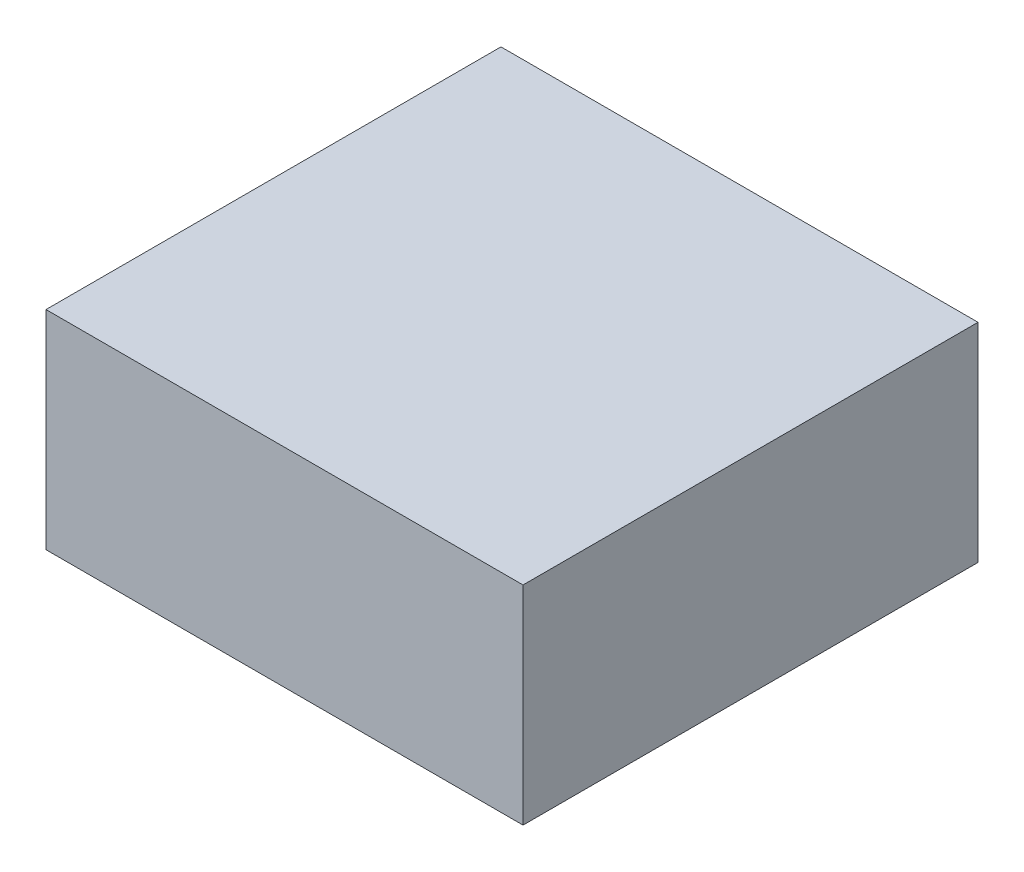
from build123d import *

# Parameters (mm, degrees)
SKETCH1_W          = 13.1064
SKETCH1_H          = 5.715
EXTRUDE1_DEPTH     = 12.5
SKETCH2_W          = 8.1064
SKETCH2_H          = 1.1425
CUT_EXTRUDE1_DEPTH = 10


with BuildPart() as part:
    # Sketch1 → Extrude1 (new body)
    with BuildSketch(Plane.XY):
        Rectangle(SKETCH1_W, SKETCH1_H)
    extrude(amount=EXTRUDE1_DEPTH)

    # Sketch2 → Cut-Extrude1 (cut)
    with BuildSketch(Plane(origin=(0, 0, 0), x_dir=(-1, 0, 0), z_dir=(0, 0, -1))):
        Polygon((-5.0532, 0), (-5.0532, -1.3575), (5.0532, -1.3575), (5.0532, 0), (5.0532, 1.6425), (-5.0532, 1.6425), align=None)
        with Locations((0, 0.57125)):
            Rectangle(SKETCH2_W, SKETCH2_H, mode=Mode.SUBTRACT)
    extrude(amount=-CUT_EXTRUDE1_DEPTH, mode=Mode.SUBTRACT)


solid = part.part
